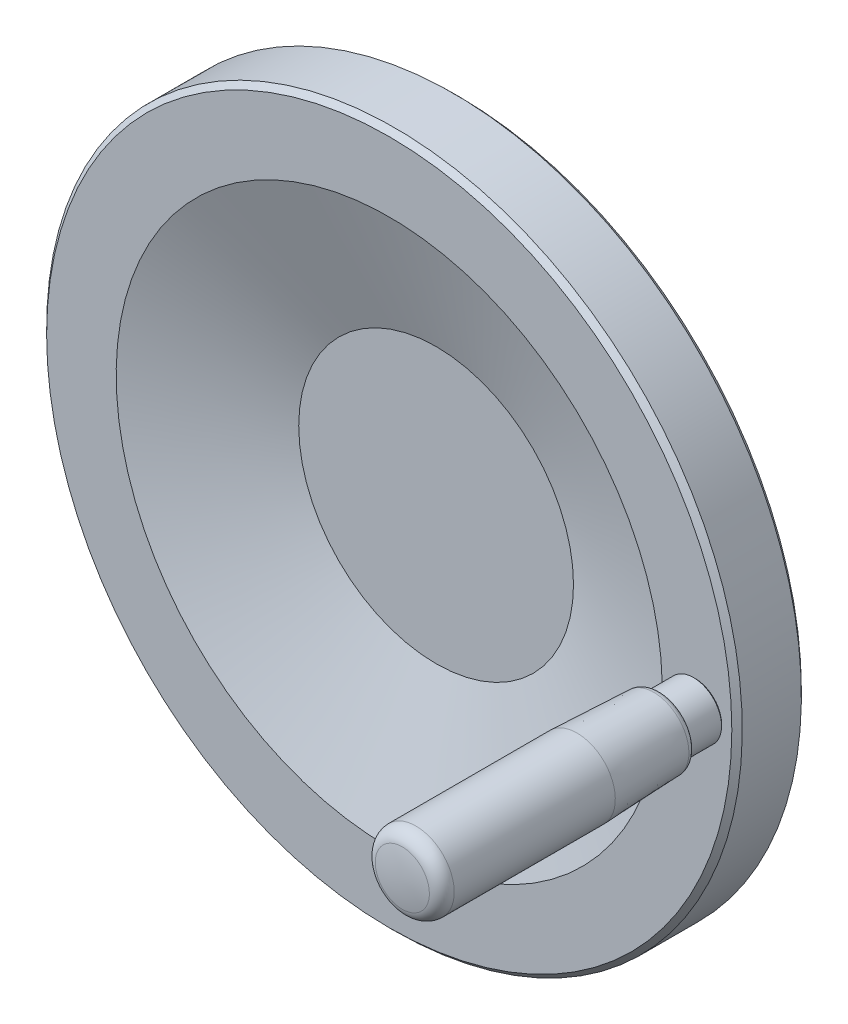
ISO-10303-21;
HEADER;
FILE_DESCRIPTION(('STEP AP214'),'2;1');
FILE_NAME('part.step','',(''),(''),'','','');
FILE_SCHEMA(('AUTOMOTIVE_DESIGN { 1 0 10303 214 1 1 1 1 }'));
ENDSEC;
DATA;
#1=APPLICATION_CONTEXT('core data for automotive mechanical design processes');
#2=APPLICATION_PROTOCOL_DEFINITION('international standard','automotive_design',2000,#1);
#3=PRODUCT_CONTEXT('',#1,'mechanical');
#4=PRODUCT('Part','Part','',(#3));
#5=PRODUCT_RELATED_PRODUCT_CATEGORY('part','',(#4));
#6=PRODUCT_DEFINITION_FORMATION('','',#4);
#7=PRODUCT_DEFINITION_CONTEXT('part definition',#1,'design');
#8=PRODUCT_DEFINITION('design','',#6,#7);
#9=PRODUCT_DEFINITION_SHAPE('','',#8);
#10=(LENGTH_UNIT() NAMED_UNIT(*) SI_UNIT(.MILLI.,.METRE.));
#11=(NAMED_UNIT(*) PLANE_ANGLE_UNIT() SI_UNIT($,.RADIAN.));
#12=(NAMED_UNIT(*) SI_UNIT($,.STERADIAN.) SOLID_ANGLE_UNIT());
#13=UNCERTAINTY_MEASURE_WITH_UNIT(LENGTH_MEASURE(1.E-05),#10,'distance_accuracy_value','');
#14=(GEOMETRIC_REPRESENTATION_CONTEXT(3) GLOBAL_UNCERTAINTY_ASSIGNED_CONTEXT((#13)) GLOBAL_UNIT_ASSIGNED_CONTEXT((#10,
#11,#12)) REPRESENTATION_CONTEXT('',''));
#15=CARTESIAN_POINT('',(0.,0.,0.));
#16=DIRECTION('',(0.,0.,1.));
#17=DIRECTION('',(1.,0.,0.));
#18=AXIS2_PLACEMENT_3D('',#15,#16,#17);
#19=CARTESIAN_POINT('',(0.,0.,55.5));
#20=DIRECTION('',(0.,0.,-1.));
#21=DIRECTION('',(0.,1.,0.));
#22=AXIS2_PLACEMENT_3D('',#19,#20,#21);
#23=CONICAL_SURFACE('',#22,100.,0.785398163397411);
#24=CARTESIAN_POINT('',(0.,0.,57.));
#25=DIRECTION('',(0.,0.,1.));
#26=DIRECTION('',(0.,-1.,0.));
#27=AXIS2_PLACEMENT_3D('',#24,#25,#26);
#28=CIRCLE('',#27,98.5);
#29=CARTESIAN_POINT('',(0.,-98.5,57.));
#30=VERTEX_POINT('',#29);
#31=EDGE_CURVE('E15',#30,#30,#28,.T.);
#32=ORIENTED_EDGE('',*,*,#31,.F.);
#33=EDGE_LOOP('',(#32));
#34=FACE_BOUND('',#33,.T.);
#35=CARTESIAN_POINT('',(0.,0.,55.5));
#36=DIRECTION('',(0.,0.,1.));
#37=DIRECTION('',(0.,-1.,0.));
#38=AXIS2_PLACEMENT_3D('',#35,#36,#37);
#39=CIRCLE('',#38,100.);
#40=CARTESIAN_POINT('',(0.,-100.,55.5));
#41=VERTEX_POINT('',#40);
#42=EDGE_CURVE('E28',#41,#41,#39,.T.);
#43=ORIENTED_EDGE('',*,*,#42,.T.);
#44=EDGE_LOOP('',(#43));
#45=FACE_BOUND('',#44,.T.);
#46=ADVANCED_FACE('F12',(#34,#45),#23,.T.);
#47=CARTESIAN_POINT('',(78.5,0.,57.0000000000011));
#48=DIRECTION('',(0.,0.,1.));
#49=DIRECTION('',(0.,-1.,0.));
#50=AXIS2_PLACEMENT_3D('',#47,#48,#49);
#51=PLANE('',#50);
#52=CARTESIAN_POINT('',(88.,0.,57.0000000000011));
#53=DIRECTION('',(0.,0.,1.));
#54=DIRECTION('',(0.,-1.,0.));
#55=AXIS2_PLACEMENT_3D('',#52,#53,#54);
#56=CIRCLE('',#55,7.55036748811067);
#57=CARTESIAN_POINT('',(88.,-7.55036748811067,57.0000000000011));
#58=VERTEX_POINT('',#57);
#59=EDGE_CURVE('E8',#58,#58,#56,.T.);
#60=ORIENTED_EDGE('',*,*,#59,.F.);
#61=EDGE_LOOP('',(#60));
#62=FACE_BOUND('',#61,.T.);
#63=ORIENTED_EDGE('',*,*,#31,.T.);
#64=EDGE_LOOP('',(#63));
#65=FACE_BOUND('',#64,.T.);
#66=CARTESIAN_POINT('',(0.,0.,57.0000000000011));
#67=DIRECTION('',(0.,0.,1.));
#68=DIRECTION('',(0.,-1.,0.));
#69=AXIS2_PLACEMENT_3D('',#66,#67,#68);
#70=CIRCLE('',#69,78.5);
#71=CARTESIAN_POINT('',(0.,-78.5,57.0000000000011));
#72=VERTEX_POINT('',#71);
#73=EDGE_CURVE('E23',#72,#72,#70,.T.);
#74=ORIENTED_EDGE('',*,*,#73,.F.);
#75=EDGE_LOOP('',(#74));
#76=FACE_BOUND('',#75,.T.);
#77=ADVANCED_FACE('F66',(#62,#65,#76),#51,.T.);
#78=CARTESIAN_POINT('',(0.,0.,43.520738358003));
#79=DIRECTION('',(0.,0.,1.));
#80=DIRECTION('',(0.,-1.,0.));
#81=AXIS2_PLACEMENT_3D('',#78,#79,#80);
#82=CONICAL_SURFACE('',#81,39.5,1.23802695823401);
#83=ORIENTED_EDGE('',*,*,#73,.T.);
#84=EDGE_LOOP('',(#83));
#85=FACE_BOUND('',#84,.T.);
#86=CARTESIAN_POINT('',(0.,0.,43.520738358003));
#87=DIRECTION('',(0.,0.,1.));
#88=DIRECTION('',(0.,-1.,0.));
#89=AXIS2_PLACEMENT_3D('',#86,#87,#88);
#90=CIRCLE('',#89,39.5);
#91=CARTESIAN_POINT('',(0.,-39.5,43.520738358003));
#92=VERTEX_POINT('',#91);
#93=EDGE_CURVE('E58',#92,#92,#90,.T.);
#94=ORIENTED_EDGE('',*,*,#93,.F.);
#95=EDGE_LOOP('',(#94));
#96=FACE_BOUND('',#95,.T.);
#97=ADVANCED_FACE('F63',(#85,#96),#82,.F.);
#98=CARTESIAN_POINT('',(0.,0.,43.520738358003));
#99=DIRECTION('',(0.,0.,1.));
#100=DIRECTION('',(0.,-1.,0.));
#101=AXIS2_PLACEMENT_3D('',#98,#99,#100);
#102=PLANE('',#101);
#103=ORIENTED_EDGE('',*,*,#93,.T.);
#104=EDGE_LOOP('',(#103));
#105=FACE_BOUND('',#104,.T.);
#106=ADVANCED_FACE('F75',(#105),#102,.T.);
#107=CARTESIAN_POINT('',(18.5,0.,0.));
#108=DIRECTION('',(0.,0.,-1.));
#109=DIRECTION('',(0.,1.,0.));
#110=AXIS2_PLACEMENT_3D('',#107,#108,#109);
#111=PLANE('',#110);
#112=CARTESIAN_POINT('',(0.,0.,0.));
#113=DIRECTION('',(0.,0.,1.));
#114=DIRECTION('',(0.,-1.,0.));
#115=AXIS2_PLACEMENT_3D('',#112,#113,#114);
#116=CIRCLE('',#115,18.5);
#117=CARTESIAN_POINT('',(0.,-18.5,0.));
#118=VERTEX_POINT('',#117);
#119=EDGE_CURVE('E55',#118,#118,#116,.T.);
#120=ORIENTED_EDGE('',*,*,#119,.F.);
#121=EDGE_LOOP('',(#120));
#122=FACE_BOUND('',#121,.T.);
#123=ADVANCED_FACE('F82',(#122),#111,.T.);
#124=CARTESIAN_POINT('',(0.,0.,1.));
#125=DIRECTION('',(0.,0.,1.));
#126=DIRECTION('',(0.,-1.,0.));
#127=AXIS2_PLACEMENT_3D('',#124,#125,#126);
#128=CONICAL_SURFACE('',#127,19.5,0.785398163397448);
#129=ORIENTED_EDGE('',*,*,#119,.T.);
#130=EDGE_LOOP('',(#129));
#131=FACE_BOUND('',#130,.T.);
#132=CARTESIAN_POINT('',(0.,0.,1.));
#133=DIRECTION('',(0.,0.,1.));
#134=DIRECTION('',(0.,-1.,0.));
#135=AXIS2_PLACEMENT_3D('',#132,#133,#134);
#136=CIRCLE('',#135,19.5);
#137=CARTESIAN_POINT('',(0.,-19.5,1.));
#138=VERTEX_POINT('',#137);
#139=EDGE_CURVE('E52',#138,#138,#136,.T.);
#140=ORIENTED_EDGE('',*,*,#139,.F.);
#141=EDGE_LOOP('',(#140));
#142=FACE_BOUND('',#141,.T.);
#143=ADVANCED_FACE('F86',(#131,#142),#128,.T.);
#144=CARTESIAN_POINT('',(0.,0.,72.));
#145=DIRECTION('',(0.,0.,1.));
#146=DIRECTION('',(0.,-1.,0.));
#147=AXIS2_PLACEMENT_3D('',#144,#145,#146);
#148=CYLINDRICAL_SURFACE('',#147,19.5);
#149=ORIENTED_EDGE('',*,*,#139,.T.);
#150=EDGE_LOOP('',(#149));
#151=FACE_BOUND('',#150,.T.);
#152=CARTESIAN_POINT('',(0.,0.,18.000000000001));
#153=DIRECTION('',(0.,0.,1.));
#154=DIRECTION('',(0.,-1.,0.));
#155=AXIS2_PLACEMENT_3D('',#152,#153,#154);
#156=CIRCLE('',#155,19.5);
#157=CARTESIAN_POINT('',(0.,-19.5,18.000000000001));
#158=VERTEX_POINT('',#157);
#159=EDGE_CURVE('E49',#158,#158,#156,.T.);
#160=ORIENTED_EDGE('',*,*,#159,.F.);
#161=EDGE_LOOP('',(#160));
#162=FACE_BOUND('',#161,.T.);
#163=ADVANCED_FACE('F90',(#151,#162),#148,.T.);
#164=CARTESIAN_POINT('',(24.4999999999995,0.,18.000000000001));
#165=DIRECTION('',(0.,0.,-1.));
#166=DIRECTION('',(0.,1.,0.));
#167=AXIS2_PLACEMENT_3D('',#164,#165,#166);
#168=PLANE('',#167);
#169=ORIENTED_EDGE('',*,*,#159,.T.);
#170=EDGE_LOOP('',(#169));
#171=FACE_BOUND('',#170,.T.);
#172=CARTESIAN_POINT('',(0.,0.,18.000000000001));
#173=DIRECTION('',(0.,0.,1.));
#174=DIRECTION('',(0.,-1.,0.));
#175=AXIS2_PLACEMENT_3D('',#172,#173,#174);
#176=CIRCLE('',#175,24.4999999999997);
#177=CARTESIAN_POINT('',(0.,-24.4999999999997,18.000000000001));
#178=VERTEX_POINT('',#177);
#179=EDGE_CURVE('E46',#178,#178,#176,.T.);
#180=ORIENTED_EDGE('',*,*,#179,.F.);
#181=EDGE_LOOP('',(#180));
#182=FACE_BOUND('',#181,.T.);
#183=ADVANCED_FACE('F94',(#171,#182),#168,.T.);
#184=CARTESIAN_POINT('',(0.,0.,72.));
#185=DIRECTION('',(0.,0.,1.));
#186=DIRECTION('',(0.,-1.,0.));
#187=AXIS2_PLACEMENT_3D('',#184,#185,#186);
#188=CYLINDRICAL_SURFACE('',#187,24.4999999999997);
#189=CARTESIAN_POINT('',(0.,0.,22.027641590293));
#190=DIRECTION('',(0.,0.,1.));
#191=DIRECTION('',(0.,-1.,0.));
#192=AXIS2_PLACEMENT_3D('',#189,#190,#191);
#193=CIRCLE('',#192,24.4999999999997);
#194=CARTESIAN_POINT('',(0.,-24.4999999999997,22.027641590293));
#195=VERTEX_POINT('',#194);
#196=EDGE_CURVE('E43',#195,#195,#193,.T.);
#197=ORIENTED_EDGE('',*,*,#196,.F.);
#198=EDGE_LOOP('',(#197));
#199=FACE_BOUND('',#198,.T.);
#200=ORIENTED_EDGE('',*,*,#179,.T.);
#201=EDGE_LOOP('',(#200));
#202=FACE_BOUND('',#201,.T.);
#203=ADVANCED_FACE('F98',(#199,#202),#188,.T.);
#204=CARTESIAN_POINT('',(0.,0.,22.027641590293));
#205=DIRECTION('',(0.,0.,1.));
#206=DIRECTION('',(0.,-1.,0.));
#207=AXIS2_PLACEMENT_3D('',#204,#205,#206);
#208=TOROIDAL_SURFACE('',#207,30.4999999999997,6.);
#209=ORIENTED_EDGE('',*,*,#196,.T.);
#210=EDGE_LOOP('',(#209));
#211=FACE_BOUND('',#210,.T.);
#212=CARTESIAN_POINT('',(0.,0.,27.6277152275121));
#213=DIRECTION('',(0.,0.,1.));
#214=DIRECTION('',(0.,-1.,0.));
#215=AXIS2_PLACEMENT_3D('',#212,#213,#214);
#216=CIRCLE('',#215,28.3461255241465);
#217=CARTESIAN_POINT('',(0.,-28.3461255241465,27.6277152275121));
#218=VERTEX_POINT('',#217);
#219=EDGE_CURVE('E40',#218,#218,#216,.T.);
#220=ORIENTED_EDGE('',*,*,#219,.F.);
#221=EDGE_LOOP('',(#220));
#222=FACE_BOUND('',#221,.T.);
#223=ADVANCED_FACE('F102',(#211,#222),#208,.F.);
#224=CARTESIAN_POINT('',(0.,0.,27.6277152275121));
#225=DIRECTION('',(0.,0.,1.));
#226=DIRECTION('',(0.,-1.,0.));
#227=AXIS2_PLACEMENT_3D('',#224,#225,#226);
#228=CONICAL_SURFACE('',#227,28.3461255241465,1.2036224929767);
#229=CARTESIAN_POINT('',(0.,0.,37.000000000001));
#230=DIRECTION('',(0.,0.,1.));
#231=DIRECTION('',(0.,-1.,0.));
#232=AXIS2_PLACEMENT_3D('',#229,#230,#231);
#233=CIRCLE('',#232,52.7140659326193);
#234=CARTESIAN_POINT('',(0.,-52.7140659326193,37.000000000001));
#235=VERTEX_POINT('',#234);
#236=EDGE_CURVE('E37',#235,#235,#233,.T.);
#237=ORIENTED_EDGE('',*,*,#236,.F.);
#238=EDGE_LOOP('',(#237));
#239=FACE_BOUND('',#238,.T.);
#240=ORIENTED_EDGE('',*,*,#219,.T.);
#241=EDGE_LOOP('',(#240));
#242=FACE_BOUND('',#241,.T.);
#243=ADVANCED_FACE('F106',(#239,#242),#228,.T.);
#244=CARTESIAN_POINT('',(52.7140659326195,0.,37.000000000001));
#245=DIRECTION('',(0.,0.,1.));
#246=DIRECTION('',(0.,-1.,0.));
#247=AXIS2_PLACEMENT_3D('',#244,#245,#246);
#248=PLANE('',#247);
#249=CARTESIAN_POINT('',(0.,0.,37.000000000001));
#250=DIRECTION('',(0.,0.,1.));
#251=DIRECTION('',(0.,-1.,0.));
#252=AXIS2_PLACEMENT_3D('',#249,#250,#251);
#253=CIRCLE('',#252,98.5);
#254=CARTESIAN_POINT('',(0.,-98.5,37.000000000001));
#255=VERTEX_POINT('',#254);
#256=EDGE_CURVE('E34',#255,#255,#253,.T.);
#257=ORIENTED_EDGE('',*,*,#256,.F.);
#258=EDGE_LOOP('',(#257));
#259=FACE_BOUND('',#258,.T.);
#260=ORIENTED_EDGE('',*,*,#236,.T.);
#261=EDGE_LOOP('',(#260));
#262=FACE_BOUND('',#261,.T.);
#263=ADVANCED_FACE('F110',(#259,#262),#248,.F.);
#264=CARTESIAN_POINT('',(0.,0.,38.5));
#265=DIRECTION('',(0.,0.,1.));
#266=DIRECTION('',(0.,-1.,0.));
#267=AXIS2_PLACEMENT_3D('',#264,#265,#266);
#268=CONICAL_SURFACE('',#267,100.,0.785398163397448);
#269=ORIENTED_EDGE('',*,*,#256,.T.);
#270=EDGE_LOOP('',(#269));
#271=FACE_BOUND('',#270,.T.);
#272=CARTESIAN_POINT('',(0.,0.,38.5));
#273=DIRECTION('',(0.,0.,1.));
#274=DIRECTION('',(0.,-1.,0.));
#275=AXIS2_PLACEMENT_3D('',#272,#273,#274);
#276=CIRCLE('',#275,100.);
#277=CARTESIAN_POINT('',(0.,-100.,38.5));
#278=VERTEX_POINT('',#277);
#279=EDGE_CURVE('E31',#278,#278,#276,.T.);
#280=ORIENTED_EDGE('',*,*,#279,.F.);
#281=EDGE_LOOP('',(#280));
#282=FACE_BOUND('',#281,.T.);
#283=ADVANCED_FACE('F114',(#271,#282),#268,.T.);
#284=CARTESIAN_POINT('',(0.,0.,72.));
#285=DIRECTION('',(0.,0.,1.));
#286=DIRECTION('',(0.,-1.,0.));
#287=AXIS2_PLACEMENT_3D('',#284,#285,#286);
#288=CYLINDRICAL_SURFACE('',#287,100.);
#289=ORIENTED_EDGE('',*,*,#279,.T.);
#290=EDGE_LOOP('',(#289));
#291=FACE_BOUND('',#290,.T.);
#292=ORIENTED_EDGE('',*,*,#42,.F.);
#293=EDGE_LOOP('',(#292));
#294=FACE_BOUND('',#293,.T.);
#295=ADVANCED_FACE('F118',(#291,#294),#288,.T.);
#296=CARTESIAN_POINT('',(88.,0.,57.500000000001));
#297=DIRECTION('',(0.,0.,1.));
#298=DIRECTION('',(0.,-1.,0.));
#299=AXIS2_PLACEMENT_3D('',#296,#297,#298);
#300=CONICAL_SURFACE('',#299,8.05036748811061,0.785398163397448);
#301=ORIENTED_EDGE('',*,*,#59,.T.);
#302=EDGE_LOOP('',(#301));
#303=FACE_BOUND('',#302,.T.);
#304=CARTESIAN_POINT('',(88.,0.,57.500000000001));
#305=DIRECTION('',(0.,0.,1.));
#306=DIRECTION('',(0.,-1.,0.));
#307=AXIS2_PLACEMENT_3D('',#304,#305,#306);
#308=CIRCLE('',#307,8.05036748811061);
#309=CARTESIAN_POINT('',(88.,-8.05036748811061,57.500000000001));
#310=VERTEX_POINT('',#309);
#311=EDGE_CURVE('E26',#310,#310,#308,.T.);
#312=ORIENTED_EDGE('',*,*,#311,.F.);
#313=EDGE_LOOP('',(#312));
#314=FACE_BOUND('',#313,.T.);
#315=ADVANCED_FACE('F122',(#303,#314),#300,.T.);
#316=CARTESIAN_POINT('',(88.,0.,157.));
#317=DIRECTION('',(0.,0.,1.));
#318=DIRECTION('',(0.,-1.,0.));
#319=AXIS2_PLACEMENT_3D('',#316,#317,#318);
#320=CYLINDRICAL_SURFACE('',#319,8.05036748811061);
#321=CARTESIAN_POINT('',(88.,0.,66.500000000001));
#322=DIRECTION('',(0.,0.,1.));
#323=DIRECTION('',(0.,-1.,0.));
#324=AXIS2_PLACEMENT_3D('',#321,#322,#323);
#325=CIRCLE('',#324,8.05036748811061);
#326=CARTESIAN_POINT('',(88.,-8.05036748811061,66.500000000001));
#327=VERTEX_POINT('',#326);
#328=EDGE_CURVE('E179',#327,#327,#325,.T.);
#329=ORIENTED_EDGE('',*,*,#328,.F.);
#330=EDGE_LOOP('',(#329));
#331=FACE_BOUND('',#330,.T.);
#332=ORIENTED_EDGE('',*,*,#311,.T.);
#333=EDGE_LOOP('',(#332));
#334=FACE_BOUND('',#333,.T.);
#335=ADVANCED_FACE('F126',(#331,#334),#320,.T.);
#336=CARTESIAN_POINT('',(88.,0.,66.500000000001));
#337=DIRECTION('',(0.,0.,-1.));
#338=DIRECTION('',(0.,1.,0.));
#339=AXIS2_PLACEMENT_3D('',#336,#337,#338);
#340=CONICAL_SURFACE('',#339,8.05036748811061,0.785398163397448);
#341=CARTESIAN_POINT('',(88.,0.,67.0000000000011));
#342=DIRECTION('',(0.,0.,1.));
#343=DIRECTION('',(0.,-1.,0.));
#344=AXIS2_PLACEMENT_3D('',#341,#342,#343);
#345=CIRCLE('',#344,7.55036748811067);
#346=CARTESIAN_POINT('',(88.,-7.55036748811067,67.0000000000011));
#347=VERTEX_POINT('',#346);
#348=EDGE_CURVE('E177',#347,#347,#345,.T.);
#349=ORIENTED_EDGE('',*,*,#348,.F.);
#350=EDGE_LOOP('',(#349));
#351=FACE_BOUND('',#350,.T.);
#352=ORIENTED_EDGE('',*,*,#328,.T.);
#353=EDGE_LOOP('',(#352));
#354=FACE_BOUND('',#353,.T.);
#355=ADVANCED_FACE('F129',(#351,#354),#340,.T.);
#356=CARTESIAN_POINT('',(95.5503674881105,0.,67.0000000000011));
#357=DIRECTION('',(0.,0.,1.));
#358=DIRECTION('',(0.,-1.,0.));
#359=AXIS2_PLACEMENT_3D('',#356,#357,#358);
#360=PLANE('',#359);
#361=CARTESIAN_POINT('',(88.,0.,67.0000000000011));
#362=DIRECTION('',(0.,0.,1.));
#363=DIRECTION('',(0.,-1.,0.));
#364=AXIS2_PLACEMENT_3D('',#361,#362,#363);
#365=CIRCLE('',#364,7.63196546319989);
#366=CARTESIAN_POINT('',(88.,-7.63196546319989,67.0000000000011));
#367=VERTEX_POINT('',#366);
#368=EDGE_CURVE('E174',#367,#367,#365,.T.);
#369=ORIENTED_EDGE('',*,*,#368,.F.);
#370=EDGE_LOOP('',(#369));
#371=FACE_BOUND('',#370,.T.);
#372=ORIENTED_EDGE('',*,*,#348,.T.);
#373=EDGE_LOOP('',(#372));
#374=FACE_BOUND('',#373,.T.);
#375=ADVANCED_FACE('F133',(#371,#374),#360,.F.);
#376=CARTESIAN_POINT('',(88.,0.,68.949141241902));
#377=DIRECTION('',(0.,0.,1.));
#378=DIRECTION('',(0.,-1.,0.));
#379=AXIS2_PLACEMENT_3D('',#376,#377,#378);
#380=TOROIDAL_SURFACE('',#379,8.08012661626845,2.);
#381=CARTESIAN_POINT('',(88.,0.,68.916738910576));
#382=DIRECTION('',(0.,0.,1.));
#383=DIRECTION('',(0.,-1.,0.));
#384=AXIS2_PLACEMENT_3D('',#381,#382,#383);
#385=CIRCLE('',#384,10.0798641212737);
#386=CARTESIAN_POINT('',(88.,-10.0798641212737,68.916738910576));
#387=VERTEX_POINT('',#386);
#388=EDGE_CURVE('E171',#387,#387,#385,.T.);
#389=ORIENTED_EDGE('',*,*,#388,.F.);
#390=EDGE_LOOP('',(#389));
#391=FACE_BOUND('',#390,.T.);
#392=ORIENTED_EDGE('',*,*,#368,.T.);
#393=EDGE_LOOP('',(#392));
#394=FACE_BOUND('',#393,.T.);
#395=ADVANCED_FACE('F137',(#391,#394),#380,.T.);
#396=CARTESIAN_POINT('',(88.,0.,91.0000000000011));
#397=DIRECTION('',(0.,0.,1.));
#398=DIRECTION('',(0.,-1.,0.));
#399=AXIS2_PLACEMENT_3D('',#396,#397,#398);
#400=CONICAL_SURFACE('',#399,11.,0.0416425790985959);
#401=ORIENTED_EDGE('',*,*,#388,.T.);
#402=EDGE_LOOP('',(#401));
#403=FACE_BOUND('',#402,.T.);
#404=CARTESIAN_POINT('',(88.,0.,91.0000000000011));
#405=DIRECTION('',(0.,0.,1.));
#406=DIRECTION('',(0.,-1.,0.));
#407=AXIS2_PLACEMENT_3D('',#404,#405,#406);
#408=CIRCLE('',#407,11.);
#409=CARTESIAN_POINT('',(88.,-11.,91.0000000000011));
#410=VERTEX_POINT('',#409);
#411=EDGE_CURVE('E166',#410,#410,#408,.T.);
#412=ORIENTED_EDGE('',*,*,#411,.F.);
#413=EDGE_LOOP('',(#412));
#414=FACE_BOUND('',#413,.T.);
#415=ADVANCED_FACE('F141',(#403,#414),#400,.T.);
#416=CARTESIAN_POINT('',(88.,0.,157.));
#417=DIRECTION('',(0.,0.,1.));
#418=DIRECTION('',(0.,-1.,0.));
#419=AXIS2_PLACEMENT_3D('',#416,#417,#418);
#420=CYLINDRICAL_SURFACE('',#419,11.);
#421=ORIENTED_EDGE('',*,*,#411,.T.);
#422=EDGE_LOOP('',(#421));
#423=FACE_BOUND('',#422,.T.);
#424=CARTESIAN_POINT('',(88.,0.,137.31288716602));
#425=DIRECTION('',(0.,0.,1.));
#426=DIRECTION('',(0.,-1.,0.));
#427=AXIS2_PLACEMENT_3D('',#424,#425,#426);
#428=CIRCLE('',#427,11.);
#429=CARTESIAN_POINT('',(88.,-11.,137.31288716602));
#430=VERTEX_POINT('',#429);
#431=EDGE_CURVE('E163',#430,#430,#428,.T.);
#432=ORIENTED_EDGE('',*,*,#431,.F.);
#433=EDGE_LOOP('',(#432));
#434=FACE_BOUND('',#433,.T.);
#435=ADVANCED_FACE('F145',(#423,#434),#420,.T.);
#436=CARTESIAN_POINT('',(88.,0.,137.31288716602));
#437=DIRECTION('',(0.,0.,1.));
#438=DIRECTION('',(0.,-1.,0.));
#439=AXIS2_PLACEMENT_3D('',#436,#437,#438);
#440=TOROIDAL_SURFACE('',#439,6.9999999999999,3.99999999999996);
#441=CARTESIAN_POINT('',(88.,0.,141.236541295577));
#442=DIRECTION('',(0.,0.,1.));
#443=DIRECTION('',(0.,-1.,0.));
#444=AXIS2_PLACEMENT_3D('',#441,#442,#443);
#445=CIRCLE('',#444,7.77777777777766);
#446=CARTESIAN_POINT('',(88.,-7.77777777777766,141.236541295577));
#447=VERTEX_POINT('',#446);
#448=EDGE_CURVE('E162',#447,#447,#445,.T.);
#449=ORIENTED_EDGE('',*,*,#448,.F.);
#450=EDGE_LOOP('',(#449));
#451=FACE_BOUND('',#450,.T.);
#452=ORIENTED_EDGE('',*,*,#431,.T.);
#453=EDGE_LOOP('',(#452));
#454=FACE_BOUND('',#453,.T.);
#455=ADVANCED_FACE('F149',(#451,#454),#440,.T.);
#456=CARTESIAN_POINT('',(88.,0.,102.));
#457=DIRECTION('',(0.,-1.,0.));
#458=DIRECTION('',(0.,0.,-1.));
#459=AXIS2_PLACEMENT_3D('',#456,#457,#458);
#460=SPHERICAL_SURFACE('',#459,40.);
#461=CARTESIAN_POINT('',(88.,0.,102.));
#462=DIRECTION('',(0.,0.,1.));
#463=DIRECTION('',(0.,-1.,0.));
#464=AXIS2_PLACEMENT_3D('',#461,#462,#463);
#465=SPHERICAL_SURFACE('',#464,40.);
#466=ORIENTED_EDGE('',*,*,#448,.T.);
#467=EDGE_LOOP('',(#466));
#468=FACE_BOUND('',#467,.T.);
#469=ADVANCED_FACE('F153',(#468),#465,.T.);
#470=CLOSED_SHELL('',(#46,#77,#97,#106,#123,#143,#163,#183,#203,#223,#243,#263,#283,#295,#315,
#335,#355,#375,#395,#415,#435,#455,#469));
#471=MANIFOLD_SOLID_BREP('B1',#470);
#472=ADVANCED_BREP_SHAPE_REPRESENTATION('',(#18,#471),#14);
#473=SHAPE_DEFINITION_REPRESENTATION(#9,#472);
ENDSEC;
END-ISO-10303-21;
